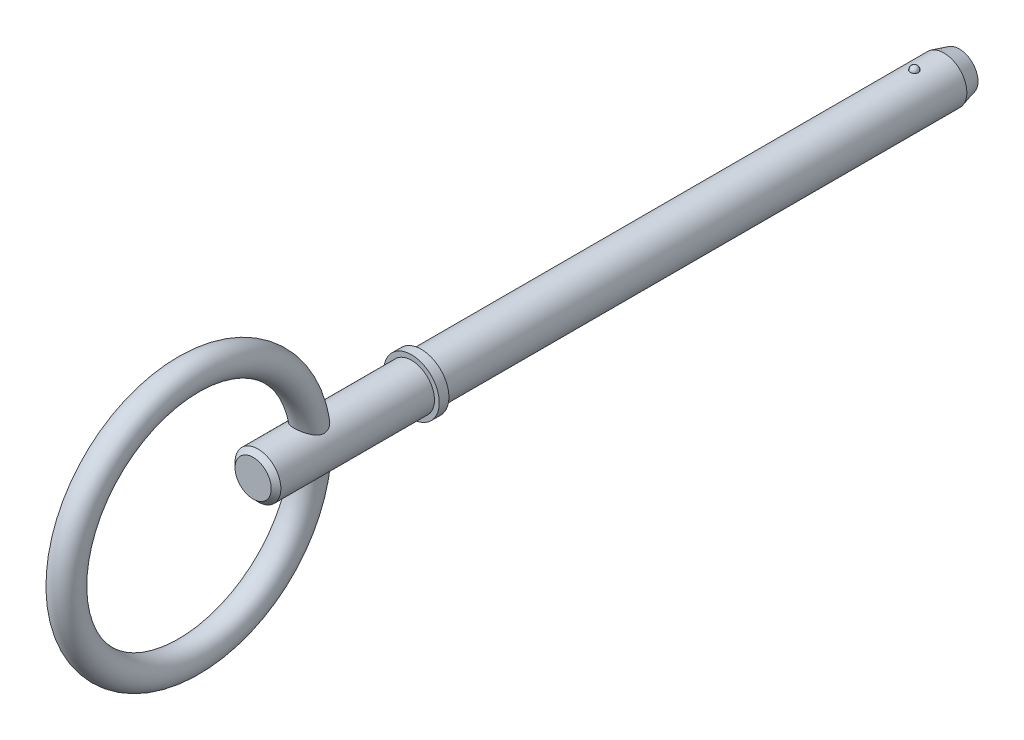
from build123d import *

# Parameters (mm, degrees)
SKETCH2_R           = 2.38
BOSS_EXTRUDE1_DEPTH = 50.8
BOSS_EXTRUDE2_START = 5.08
SKETCH3_R           = 2.38
BOSS_EXTRUDE2_DEPTH = 5.08
CHAMFER1_SIZE       = 1.586
CHAMFER1_SIZE2      = 0.424967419
SKETCH20_W          = 1
SKETCH20_H          = 2.88
SKETCH21_R          = 2.38
BOSS_EXTRUDE3_DEPTH = 17.45
CHAMFER2_SIZE       = 0.5
SKETCH24_R          = 1.5


with BuildPart() as part:
    # Sketch2 → Boss-Extrude1 (new body)
    with BuildSketch(Plane.XY):
        Circle(SKETCH2_R)
    extrude(amount=BOSS_EXTRUDE1_DEPTH)

    # Sketch3 → Boss-Extrude2 (add)
    with BuildSketch(Plane(origin=(0, 0, 0), x_dir=(-1, 0, 0), z_dir=(0, 0, -1)).offset(BOSS_EXTRUDE2_START)):
        Circle(SKETCH3_R)
    extrude(amount=-BOSS_EXTRUDE2_DEPTH)

    # Chamfer1
    chamfer1_edges = [part.edges().sort_by_distance(p)[0] for p in [
        (2.38, 0, -5.08),
    ]]
    chamfer1_side = [part.faces().sort_by_distance(p)[0] for p in [
        (2.38, 0, -2.54),
    ]]
    chamfer(chamfer1_edges, length=CHAMFER1_SIZE, length2=CHAMFER1_SIZE2, reference=chamfer1_side[0])

    # Sketch18 → Revolve1 (revolve)
    with BuildSketch(Plane(origin=(0, 0, 0), x_dir=(0, 0, -1), z_dir=(1, 0, 0))):
        with BuildLine():
            Line((0.42, 2.8), (0.42, 1.96))
            ThreePointArc((0.42, 1.96), (0, 2.38), (0.42, 2.8))
        make_face()
    revolve(axis=Axis((0, 2.8, -0.42), (0, -1, 0)))

    # Sketch20 → Revolve2 (revolve)
    with BuildSketch(Plane(origin=(0, 0, 0), x_dir=(0, 0, -1), z_dir=(1, 0, 0)), mode=Mode.PRIVATE) as revolve2_sk:
        with Locations((-51.3, 1.44)):
            Rectangle(SKETCH20_W, SKETCH20_H)
    revolve(revolve2_sk.sketch.rotate(Axis((0, 0, 33.728787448), (0, 0, 1)), 90), axis=Axis((0, 0, 33.728787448), (0, 0, 1)))

    # Sketch21 → Boss-Extrude3 (add)
    with BuildSketch(Plane(origin=(0, 0, 50.8), x_dir=(-1, 0, 0), z_dir=(0, 0, -1))):
        Circle(SKETCH21_R)
    extrude(amount=-BOSS_EXTRUDE3_DEPTH)

    # Chamfer2
    chamfer2_edges = [part.edges().sort_by_distance(p)[0] for p in [
        (2.38, 0, 68.25),
    ]]
    chamfer(chamfer2_edges, length=CHAMFER2_SIZE)

    # Sweep1: sweep along a path in Sketch23
    with BuildLine(Plane(origin=(0, 0, 0), x_dir=(0, 0, -1), z_dir=(1, 0, 0))) as sweep1_path:
        CenterArc((-74.95, 0), 12.7, 0, 360)
    # Sketch24 → Sweep1 (sweep)
    with BuildSketch(Plane(origin=(0, 0, 0), x_dir=(1, 0, 0), z_dir=(0, 1, 0))):
        with Locations((0, -62.25)):
            Circle(SKETCH24_R)
    sweep(path=sweep1_path.line)


solid = part.part
